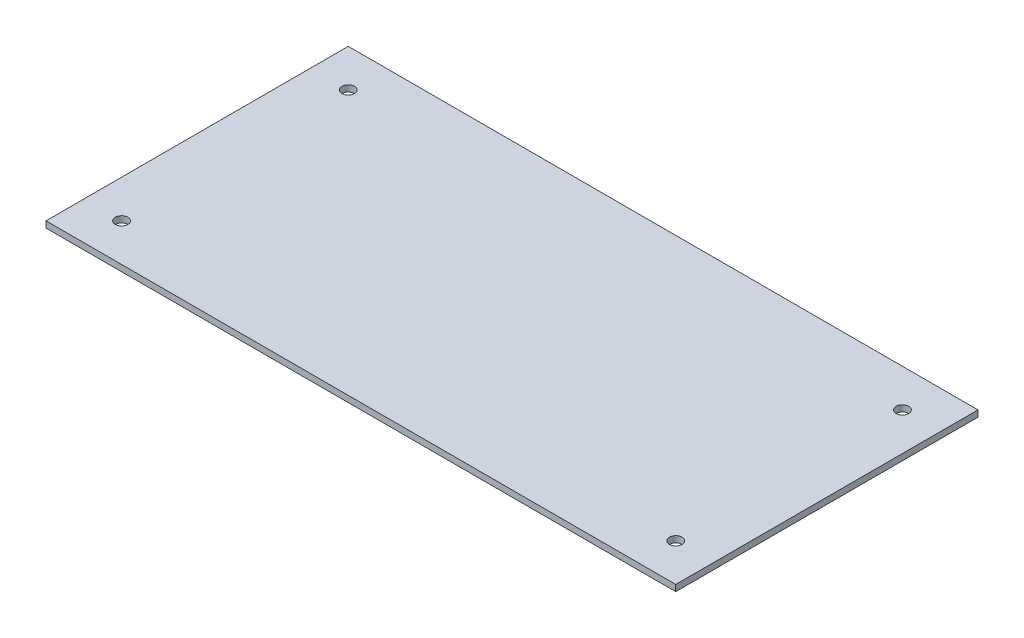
ISO-10303-21;
HEADER;
FILE_DESCRIPTION(('STEP AP214'),'2;1');
FILE_NAME('part.step','',(''),(''),'','','');
FILE_SCHEMA(('AUTOMOTIVE_DESIGN { 1 0 10303 214 1 1 1 1 }'));
ENDSEC;
DATA;
#1=APPLICATION_CONTEXT('core data for automotive mechanical design processes');
#2=APPLICATION_PROTOCOL_DEFINITION('international standard','automotive_design',2000,#1);
#3=PRODUCT_CONTEXT('',#1,'mechanical');
#4=PRODUCT('Part','Part','',(#3));
#5=PRODUCT_RELATED_PRODUCT_CATEGORY('part','',(#4));
#6=PRODUCT_DEFINITION_FORMATION('','',#4);
#7=PRODUCT_DEFINITION_CONTEXT('part definition',#1,'design');
#8=PRODUCT_DEFINITION('design','',#6,#7);
#9=PRODUCT_DEFINITION_SHAPE('','',#8);
#10=(LENGTH_UNIT() NAMED_UNIT(*) SI_UNIT(.MILLI.,.METRE.));
#11=(NAMED_UNIT(*) PLANE_ANGLE_UNIT() SI_UNIT($,.RADIAN.));
#12=(NAMED_UNIT(*) SI_UNIT($,.STERADIAN.) SOLID_ANGLE_UNIT());
#13=UNCERTAINTY_MEASURE_WITH_UNIT(LENGTH_MEASURE(1.E-05),#10,'distance_accuracy_value','');
#14=(GEOMETRIC_REPRESENTATION_CONTEXT(3) GLOBAL_UNCERTAINTY_ASSIGNED_CONTEXT((#13)) GLOBAL_UNIT_ASSIGNED_CONTEXT((#10,
#11,#12)) REPRESENTATION_CONTEXT('',''));
#15=CARTESIAN_POINT('',(0.,0.,0.));
#16=DIRECTION('',(0.,0.,1.));
#17=DIRECTION('',(1.,0.,0.));
#18=AXIS2_PLACEMENT_3D('',#15,#16,#17);
#19=CARTESIAN_POINT('',(-1270.,25.4,609.6));
#20=DIRECTION('',(0.,1.,0.));
#21=DIRECTION('',(0.,0.,1.));
#22=AXIS2_PLACEMENT_3D('',#19,#20,#21);
#23=PLANE('',#22);
#24=CARTESIAN_POINT('',(-1117.6,25.4,457.2));
#25=DIRECTION('',(0.,-1.,0.));
#26=DIRECTION('',(0.,0.,-1.));
#27=AXIS2_PLACEMENT_3D('',#24,#25,#26);
#28=CIRCLE('',#27,25.3999999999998);
#29=CARTESIAN_POINT('',(-1117.6,25.4,431.800000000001));
#30=VERTEX_POINT('',#29);
#31=EDGE_CURVE('E116',#30,#30,#28,.T.);
#32=ORIENTED_EDGE('',*,*,#31,.T.);
#33=EDGE_LOOP('',(#32));
#34=FACE_BOUND('',#33,.T.);
#35=CARTESIAN_POINT('',(-1117.6,25.4,-457.2));
#36=DIRECTION('',(0.,1.,0.));
#37=DIRECTION('',(0.,0.,1.));
#38=AXIS2_PLACEMENT_3D('',#35,#36,#37);
#39=CIRCLE('',#38,25.3999999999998);
#40=CARTESIAN_POINT('',(-1117.6,25.4,-431.800000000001));
#41=VERTEX_POINT('',#40);
#42=EDGE_CURVE('E110',#41,#41,#39,.T.);
#43=ORIENTED_EDGE('',*,*,#42,.F.);
#44=EDGE_LOOP('',(#43));
#45=FACE_BOUND('',#44,.T.);
#46=DIRECTION('',(0.,0.,1.));
#47=VECTOR('',#46,1.);
#48=CARTESIAN_POINT('',(-1270.,25.4,-609.6));
#49=LINE('',#48,#47);
#50=CARTESIAN_POINT('',(-1270.,25.4,-609.6));
#51=VERTEX_POINT('',#50);
#52=CARTESIAN_POINT('',(-1270.,25.4,609.6));
#53=VERTEX_POINT('',#52);
#54=EDGE_CURVE('E83',#51,#53,#49,.T.);
#55=ORIENTED_EDGE('',*,*,#54,.T.);
#56=DIRECTION('',(1.,0.,0.));
#57=VECTOR('',#56,1.);
#58=CARTESIAN_POINT('',(-1270.,25.4,609.6));
#59=LINE('',#58,#57);
#60=CARTESIAN_POINT('',(1270.,25.4,609.6));
#61=VERTEX_POINT('',#60);
#62=EDGE_CURVE('E78',#53,#61,#59,.T.);
#63=ORIENTED_EDGE('',*,*,#62,.T.);
#64=DIRECTION('',(0.,0.,-1.));
#65=VECTOR('',#64,1.);
#66=CARTESIAN_POINT('',(1270.,25.4,-609.6));
#67=LINE('',#66,#65);
#68=CARTESIAN_POINT('',(1270.,25.4,-609.6));
#69=VERTEX_POINT('',#68);
#70=EDGE_CURVE('E81',#61,#69,#67,.T.);
#71=ORIENTED_EDGE('',*,*,#70,.T.);
#72=DIRECTION('',(-1.,0.,0.));
#73=VECTOR('',#72,1.);
#74=CARTESIAN_POINT('',(-1270.,25.4,-609.6));
#75=LINE('',#74,#73);
#76=EDGE_CURVE('E48',#69,#51,#75,.T.);
#77=ORIENTED_EDGE('',*,*,#76,.T.);
#78=EDGE_LOOP('',(#55,#63,#71,#77));
#79=FACE_BOUND('',#78,.T.);
#80=CARTESIAN_POINT('',(1117.6,25.4,457.2));
#81=DIRECTION('',(0.,1.,0.));
#82=DIRECTION('',(0.,0.,-1.));
#83=AXIS2_PLACEMENT_3D('',#80,#81,#82);
#84=CIRCLE('',#83,25.3999999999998);
#85=CARTESIAN_POINT('',(1117.6,25.4,431.800000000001));
#86=VERTEX_POINT('',#85);
#87=EDGE_CURVE('E122',#86,#86,#84,.T.);
#88=ORIENTED_EDGE('',*,*,#87,.F.);
#89=EDGE_LOOP('',(#88));
#90=FACE_BOUND('',#89,.T.);
#91=CARTESIAN_POINT('',(1117.6,25.4,-457.2));
#92=DIRECTION('',(0.,-1.,0.));
#93=DIRECTION('',(0.,0.,1.));
#94=AXIS2_PLACEMENT_3D('',#91,#92,#93);
#95=CIRCLE('',#94,25.3999999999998);
#96=CARTESIAN_POINT('',(1117.6,25.4,-431.800000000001));
#97=VERTEX_POINT('',#96);
#98=EDGE_CURVE('E128',#97,#97,#95,.T.);
#99=ORIENTED_EDGE('',*,*,#98,.T.);
#100=EDGE_LOOP('',(#99));
#101=FACE_BOUND('',#100,.T.);
#102=ADVANCED_FACE('F31',(#34,#45,#79,#90,#101),#23,.T.);
#103=CARTESIAN_POINT('',(-1270.,0.,609.6));
#104=DIRECTION('',(0.,1.,0.));
#105=DIRECTION('',(0.,0.,1.));
#106=AXIS2_PLACEMENT_3D('',#103,#104,#105);
#107=PLANE('',#106);
#108=CARTESIAN_POINT('',(-1117.6,0.,457.2));
#109=DIRECTION('',(0.,-1.,0.));
#110=DIRECTION('',(0.,0.,-1.));
#111=AXIS2_PLACEMENT_3D('',#108,#109,#110);
#112=CIRCLE('',#111,25.3999999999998);
#113=CARTESIAN_POINT('',(-1117.6,0.,431.800000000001));
#114=VERTEX_POINT('',#113);
#115=EDGE_CURVE('E113',#114,#114,#112,.T.);
#116=ORIENTED_EDGE('',*,*,#115,.F.);
#117=EDGE_LOOP('',(#116));
#118=FACE_BOUND('',#117,.T.);
#119=CARTESIAN_POINT('',(-1117.6,0.,-457.2));
#120=DIRECTION('',(0.,1.,0.));
#121=DIRECTION('',(0.,0.,1.));
#122=AXIS2_PLACEMENT_3D('',#119,#120,#121);
#123=CIRCLE('',#122,25.3999999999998);
#124=CARTESIAN_POINT('',(-1117.6,0.,-431.800000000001));
#125=VERTEX_POINT('',#124);
#126=EDGE_CURVE('E98',#125,#125,#123,.T.);
#127=ORIENTED_EDGE('',*,*,#126,.T.);
#128=EDGE_LOOP('',(#127));
#129=FACE_BOUND('',#128,.T.);
#130=DIRECTION('',(0.,0.,1.));
#131=VECTOR('',#130,1.);
#132=CARTESIAN_POINT('',(-1270.,0.,-609.6));
#133=LINE('',#132,#131);
#134=CARTESIAN_POINT('',(-1270.,0.,-609.6));
#135=VERTEX_POINT('',#134);
#136=CARTESIAN_POINT('',(-1270.,0.,609.6));
#137=VERTEX_POINT('',#136);
#138=EDGE_CURVE('E95',#135,#137,#133,.T.);
#139=ORIENTED_EDGE('',*,*,#138,.F.);
#140=DIRECTION('',(-1.,0.,0.));
#141=VECTOR('',#140,1.);
#142=CARTESIAN_POINT('',(-1270.,0.,-609.6));
#143=LINE('',#142,#141);
#144=CARTESIAN_POINT('',(1270.,0.,-609.6));
#145=VERTEX_POINT('',#144);
#146=EDGE_CURVE('E71',#145,#135,#143,.T.);
#147=ORIENTED_EDGE('',*,*,#146,.F.);
#148=DIRECTION('',(0.,0.,-1.));
#149=VECTOR('',#148,1.);
#150=CARTESIAN_POINT('',(1270.,0.,-609.6));
#151=LINE('',#150,#149);
#152=CARTESIAN_POINT('',(1270.,0.,609.6));
#153=VERTEX_POINT('',#152);
#154=EDGE_CURVE('E65',#153,#145,#151,.T.);
#155=ORIENTED_EDGE('',*,*,#154,.F.);
#156=DIRECTION('',(1.,0.,0.));
#157=VECTOR('',#156,1.);
#158=CARTESIAN_POINT('',(-1270.,0.,609.6));
#159=LINE('',#158,#157);
#160=EDGE_CURVE('E87',#137,#153,#159,.T.);
#161=ORIENTED_EDGE('',*,*,#160,.F.);
#162=EDGE_LOOP('',(#139,#147,#155,#161));
#163=FACE_BOUND('',#162,.T.);
#164=CARTESIAN_POINT('',(1117.6,0.,457.2));
#165=DIRECTION('',(0.,1.,0.));
#166=DIRECTION('',(0.,0.,-1.));
#167=AXIS2_PLACEMENT_3D('',#164,#165,#166);
#168=CIRCLE('',#167,25.3999999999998);
#169=CARTESIAN_POINT('',(1117.6,0.,431.800000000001));
#170=VERTEX_POINT('',#169);
#171=EDGE_CURVE('E119',#170,#170,#168,.T.);
#172=ORIENTED_EDGE('',*,*,#171,.T.);
#173=EDGE_LOOP('',(#172));
#174=FACE_BOUND('',#173,.T.);
#175=CARTESIAN_POINT('',(1117.6,0.,-457.2));
#176=DIRECTION('',(0.,-1.,0.));
#177=DIRECTION('',(0.,0.,1.));
#178=AXIS2_PLACEMENT_3D('',#175,#176,#177);
#179=CIRCLE('',#178,25.3999999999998);
#180=CARTESIAN_POINT('',(1117.6,0.,-431.800000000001));
#181=VERTEX_POINT('',#180);
#182=EDGE_CURVE('E125',#181,#181,#179,.T.);
#183=ORIENTED_EDGE('',*,*,#182,.F.);
#184=EDGE_LOOP('',(#183));
#185=FACE_BOUND('',#184,.T.);
#186=ADVANCED_FACE('F106',(#118,#129,#163,#174,#185),#107,.F.);
#187=CARTESIAN_POINT('',(-1270.,25.4,-609.6));
#188=DIRECTION('',(1.,0.,0.));
#189=DIRECTION('',(0.,0.,-1.));
#190=AXIS2_PLACEMENT_3D('',#187,#188,#189);
#191=PLANE('',#190);
#192=ORIENTED_EDGE('',*,*,#138,.T.);
#193=DIRECTION('',(0.,-1.,0.));
#194=VECTOR('',#193,1.);
#195=CARTESIAN_POINT('',(-1270.,25.4,609.6));
#196=LINE('',#195,#194);
#197=EDGE_CURVE('E11',#53,#137,#196,.T.);
#198=ORIENTED_EDGE('',*,*,#197,.F.);
#199=ORIENTED_EDGE('',*,*,#54,.F.);
#200=DIRECTION('',(0.,-1.,0.));
#201=VECTOR('',#200,1.);
#202=CARTESIAN_POINT('',(-1270.,25.4,-609.6));
#203=LINE('',#202,#201);
#204=EDGE_CURVE('E91',#51,#135,#203,.T.);
#205=ORIENTED_EDGE('',*,*,#204,.T.);
#206=EDGE_LOOP('',(#192,#198,#199,#205));
#207=FACE_BOUND('',#206,.T.);
#208=ADVANCED_FACE('F33',(#207),#191,.F.);
#209=CARTESIAN_POINT('',(-1270.,25.4,609.6));
#210=DIRECTION('',(0.,0.,-1.));
#211=DIRECTION('',(-1.,0.,0.));
#212=AXIS2_PLACEMENT_3D('',#209,#210,#211);
#213=PLANE('',#212);
#214=ORIENTED_EDGE('',*,*,#160,.T.);
#215=DIRECTION('',(0.,-1.,0.));
#216=VECTOR('',#215,1.);
#217=CARTESIAN_POINT('',(1270.,25.4,609.6));
#218=LINE('',#217,#216);
#219=EDGE_CURVE('E40',#61,#153,#218,.T.);
#220=ORIENTED_EDGE('',*,*,#219,.F.);
#221=ORIENTED_EDGE('',*,*,#62,.F.);
#222=ORIENTED_EDGE('',*,*,#197,.T.);
#223=EDGE_LOOP('',(#214,#220,#221,#222));
#224=FACE_BOUND('',#223,.T.);
#225=ADVANCED_FACE('F86',(#224),#213,.F.);
#226=CARTESIAN_POINT('',(1270.,25.4,-609.6));
#227=DIRECTION('',(-1.,0.,0.));
#228=DIRECTION('',(0.,0.,1.));
#229=AXIS2_PLACEMENT_3D('',#226,#227,#228);
#230=PLANE('',#229);
#231=ORIENTED_EDGE('',*,*,#154,.T.);
#232=DIRECTION('',(0.,-1.,0.));
#233=VECTOR('',#232,1.);
#234=CARTESIAN_POINT('',(1270.,25.4,-609.6));
#235=LINE('',#234,#233);
#236=EDGE_CURVE('E88',#69,#145,#235,.T.);
#237=ORIENTED_EDGE('',*,*,#236,.F.);
#238=ORIENTED_EDGE('',*,*,#70,.F.);
#239=ORIENTED_EDGE('',*,*,#219,.T.);
#240=EDGE_LOOP('',(#231,#237,#238,#239));
#241=FACE_BOUND('',#240,.T.);
#242=ADVANCED_FACE('F89',(#241),#230,.F.);
#243=CARTESIAN_POINT('',(-1270.,25.4,-609.6));
#244=DIRECTION('',(0.,0.,1.));
#245=DIRECTION('',(1.,0.,0.));
#246=AXIS2_PLACEMENT_3D('',#243,#244,#245);
#247=PLANE('',#246);
#248=ORIENTED_EDGE('',*,*,#146,.T.);
#249=ORIENTED_EDGE('',*,*,#204,.F.);
#250=ORIENTED_EDGE('',*,*,#76,.F.);
#251=ORIENTED_EDGE('',*,*,#236,.T.);
#252=EDGE_LOOP('',(#248,#249,#250,#251));
#253=FACE_BOUND('',#252,.T.);
#254=ADVANCED_FACE('F103',(#253),#247,.F.);
#255=CARTESIAN_POINT('',(-1117.6,0.,-457.2));
#256=DIRECTION('',(0.,1.,0.));
#257=DIRECTION('',(0.,0.,1.));
#258=AXIS2_PLACEMENT_3D('',#255,#256,#257);
#259=CYLINDRICAL_SURFACE('',#258,25.3999999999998);
#260=ORIENTED_EDGE('',*,*,#126,.F.);
#261=EDGE_LOOP('',(#260));
#262=FACE_BOUND('',#261,.T.);
#263=ORIENTED_EDGE('',*,*,#42,.T.);
#264=EDGE_LOOP('',(#263));
#265=FACE_BOUND('',#264,.T.);
#266=ADVANCED_FACE('F152',(#262,#265),#259,.F.);
#267=CARTESIAN_POINT('',(-1117.6,0.,457.2));
#268=DIRECTION('',(0.,1.,0.));
#269=DIRECTION('',(0.,0.,1.));
#270=AXIS2_PLACEMENT_3D('',#267,#268,#269);
#271=CYLINDRICAL_SURFACE('',#270,25.3999999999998);
#272=ORIENTED_EDGE('',*,*,#115,.T.);
#273=EDGE_LOOP('',(#272));
#274=FACE_BOUND('',#273,.T.);
#275=ORIENTED_EDGE('',*,*,#31,.F.);
#276=EDGE_LOOP('',(#275));
#277=FACE_BOUND('',#276,.T.);
#278=ADVANCED_FACE('F173',(#274,#277),#271,.F.);
#279=CARTESIAN_POINT('',(1117.6,0.,457.2));
#280=DIRECTION('',(0.,1.,0.));
#281=DIRECTION('',(0.,0.,1.));
#282=AXIS2_PLACEMENT_3D('',#279,#280,#281);
#283=CYLINDRICAL_SURFACE('',#282,25.3999999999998);
#284=ORIENTED_EDGE('',*,*,#171,.F.);
#285=EDGE_LOOP('',(#284));
#286=FACE_BOUND('',#285,.T.);
#287=ORIENTED_EDGE('',*,*,#87,.T.);
#288=EDGE_LOOP('',(#287));
#289=FACE_BOUND('',#288,.T.);
#290=ADVANCED_FACE('F180',(#286,#289),#283,.F.);
#291=CARTESIAN_POINT('',(1117.6,0.,-457.2));
#292=DIRECTION('',(0.,1.,0.));
#293=DIRECTION('',(0.,0.,1.));
#294=AXIS2_PLACEMENT_3D('',#291,#292,#293);
#295=CYLINDRICAL_SURFACE('',#294,25.3999999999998);
#296=ORIENTED_EDGE('',*,*,#182,.T.);
#297=EDGE_LOOP('',(#296));
#298=FACE_BOUND('',#297,.T.);
#299=ORIENTED_EDGE('',*,*,#98,.F.);
#300=EDGE_LOOP('',(#299));
#301=FACE_BOUND('',#300,.T.);
#302=ADVANCED_FACE('F134',(#298,#301),#295,.F.);
#303=CLOSED_SHELL('',(#102,#186,#208,#225,#242,#254,#266,#278,#290,#302));
#304=MANIFOLD_SOLID_BREP('B2',#303);
#305=ADVANCED_BREP_SHAPE_REPRESENTATION('',(#18,#304),#14);
#306=SHAPE_DEFINITION_REPRESENTATION(#9,#305);
ENDSEC;
END-ISO-10303-21;
